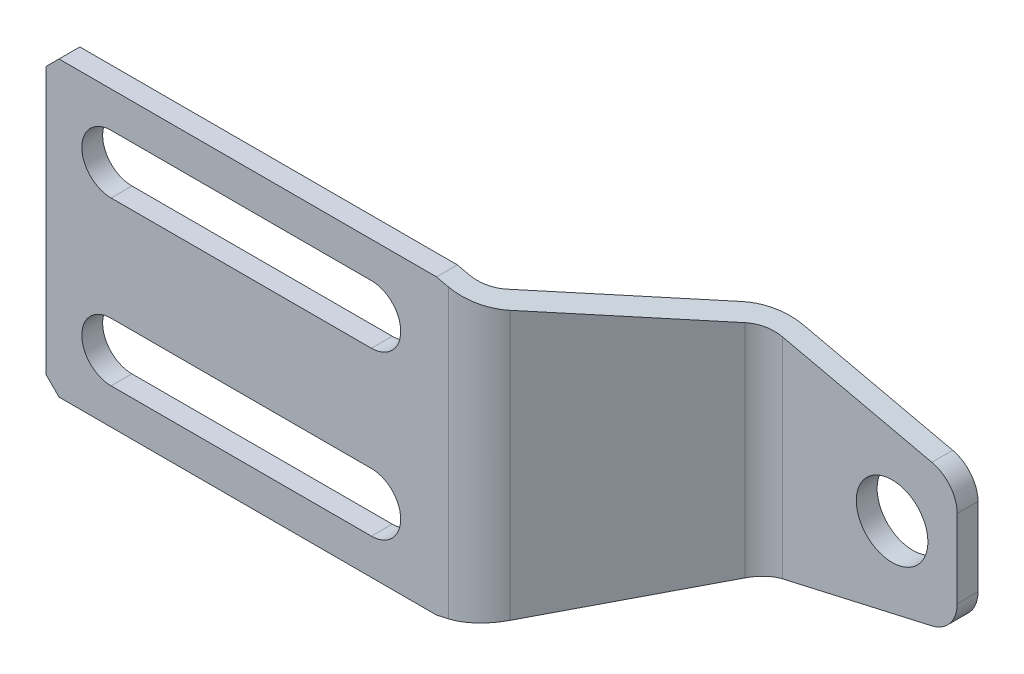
ISO-10303-21;
HEADER;
FILE_DESCRIPTION(('STEP AP214'),'2;1');
FILE_NAME('part.step','',(''),(''),'','','');
FILE_SCHEMA(('AUTOMOTIVE_DESIGN { 1 0 10303 214 1 1 1 1 }'));
ENDSEC;
DATA;
#1=APPLICATION_CONTEXT('core data for automotive mechanical design processes');
#2=APPLICATION_PROTOCOL_DEFINITION('international standard','automotive_design',2000,#1);
#3=PRODUCT_CONTEXT('',#1,'mechanical');
#4=PRODUCT('Part','Part','',(#3));
#5=PRODUCT_RELATED_PRODUCT_CATEGORY('part','',(#4));
#6=PRODUCT_DEFINITION_FORMATION('','',#4);
#7=PRODUCT_DEFINITION_CONTEXT('part definition',#1,'design');
#8=PRODUCT_DEFINITION('design','',#6,#7);
#9=PRODUCT_DEFINITION_SHAPE('','',#8);
#10=(LENGTH_UNIT() NAMED_UNIT(*) SI_UNIT(.MILLI.,.METRE.));
#11=(NAMED_UNIT(*) PLANE_ANGLE_UNIT() SI_UNIT($,.RADIAN.));
#12=(NAMED_UNIT(*) SI_UNIT($,.STERADIAN.) SOLID_ANGLE_UNIT());
#13=UNCERTAINTY_MEASURE_WITH_UNIT(LENGTH_MEASURE(1.E-05),#10,'distance_accuracy_value','');
#14=(GEOMETRIC_REPRESENTATION_CONTEXT(3) GLOBAL_UNCERTAINTY_ASSIGNED_CONTEXT((#13)) GLOBAL_UNIT_ASSIGNED_CONTEXT((#10,
#11,#12)) REPRESENTATION_CONTEXT('',''));
#15=CARTESIAN_POINT('',(0.,0.,0.));
#16=DIRECTION('',(0.,0.,1.));
#17=DIRECTION('',(1.,0.,0.));
#18=AXIS2_PLACEMENT_3D('',#15,#16,#17);
#19=CARTESIAN_POINT('',(95.,12.5,-75.));
#20=DIRECTION('',(0.,0.,1.));
#21=DIRECTION('',(0.,-1.,0.));
#22=AXIS2_PLACEMENT_3D('',#19,#20,#21);
#23=CYLINDRICAL_SURFACE('',#22,5.5);
#24=CARTESIAN_POINT('',(95.,12.5,-25.));
#25=DIRECTION('',(0.,0.,-1.));
#26=DIRECTION('',(1.,0.,0.));
#27=AXIS2_PLACEMENT_3D('',#24,#25,#26);
#28=CIRCLE('',#27,5.5);
#29=CARTESIAN_POINT('',(100.5,12.5,-25.));
#30=VERTEX_POINT('',#29);
#31=EDGE_CURVE('E238',#30,#30,#28,.F.);
#32=ORIENTED_EDGE('',*,*,#31,.F.);
#33=EDGE_LOOP('',(#32));
#34=FACE_BOUND('',#33,.T.);
#35=CARTESIAN_POINT('',(95.,12.5,-21.8));
#36=DIRECTION('',(0.,0.,1.));
#37=DIRECTION('',(0.,-1.,0.));
#38=AXIS2_PLACEMENT_3D('',#35,#36,#37);
#39=CIRCLE('',#38,5.5);
#40=CARTESIAN_POINT('',(95.,7.,-21.8));
#41=VERTEX_POINT('',#40);
#42=EDGE_CURVE('E243',#41,#41,#39,.F.);
#43=ORIENTED_EDGE('',*,*,#42,.F.);
#44=EDGE_LOOP('',(#43));
#45=FACE_BOUND('',#44,.T.);
#46=ADVANCED_FACE('F14',(#34,#45),#23,.F.);
#47=CARTESIAN_POINT('',(-10.,52.5,0.));
#48=DIRECTION('',(0.,0.,-1.));
#49=DIRECTION('',(0.,1.,0.));
#50=AXIS2_PLACEMENT_3D('',#47,#48,#49);
#51=PLANE('',#50);
#52=CARTESIAN_POINT('',(40.,25.,0.));
#53=DIRECTION('',(0.,0.,-1.));
#54=DIRECTION('',(0.,1.,0.));
#55=AXIS2_PLACEMENT_3D('',#52,#53,#54);
#56=CIRCLE('',#55,4.5);
#57=CARTESIAN_POINT('',(40.,20.5,0.));
#58=VERTEX_POINT('',#57);
#59=CARTESIAN_POINT('',(40.,29.5,0.));
#60=VERTEX_POINT('',#59);
#61=EDGE_CURVE('E320',#58,#60,#56,.F.);
#62=ORIENTED_EDGE('',*,*,#61,.T.);
#63=DIRECTION('',(-1.,0.,0.));
#64=VECTOR('',#63,1.);
#65=CARTESIAN_POINT('',(40.,29.5,0.));
#66=LINE('',#65,#64);
#67=CARTESIAN_POINT('',(0.,29.5,0.));
#68=VERTEX_POINT('',#67);
#69=EDGE_CURVE('E247',#60,#68,#66,.T.);
#70=ORIENTED_EDGE('',*,*,#69,.T.);
#71=CARTESIAN_POINT('',(0.,25.,0.));
#72=DIRECTION('',(0.,0.,-1.));
#73=DIRECTION('',(0.,1.,0.));
#74=AXIS2_PLACEMENT_3D('',#71,#72,#73);
#75=CIRCLE('',#74,4.5);
#76=CARTESIAN_POINT('',(0.,20.5,0.));
#77=VERTEX_POINT('',#76);
#78=EDGE_CURVE('E316',#68,#77,#75,.F.);
#79=ORIENTED_EDGE('',*,*,#78,.T.);
#80=DIRECTION('',(1.,0.,0.));
#81=VECTOR('',#80,1.);
#82=CARTESIAN_POINT('',(40.,20.5,0.));
#83=LINE('',#82,#81);
#84=EDGE_CURVE('E318',#77,#58,#83,.T.);
#85=ORIENTED_EDGE('',*,*,#84,.T.);
#86=EDGE_LOOP('',(#62,#70,#79,#85));
#87=FACE_BOUND('',#86,.T.);
#88=DIRECTION('',(-1.,0.,0.));
#89=VECTOR('',#88,1.);
#90=CARTESIAN_POINT('',(-8.,35.,0.));
#91=LINE('',#90,#89);
#92=CARTESIAN_POINT('',(50.,35.,0.));
#93=VERTEX_POINT('',#92);
#94=CARTESIAN_POINT('',(-8.,35.,0.));
#95=VERTEX_POINT('',#94);
#96=EDGE_CURVE('E340',#93,#95,#91,.T.);
#97=ORIENTED_EDGE('',*,*,#96,.F.);
#98=DIRECTION('',(-0.97513285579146,0.221621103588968,0.));
#99=VECTOR('',#98,1.);
#100=CARTESIAN_POINT('',(50.,35.,0.));
#101=LINE('',#100,#99);
#102=CARTESIAN_POINT('',(51.8278760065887,34.5845736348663,0.));
#103=VERTEX_POINT('',#102);
#104=EDGE_CURVE('E337',#103,#93,#101,.T.);
#105=ORIENTED_EDGE('',*,*,#104,.F.);
#106=DIRECTION('',(0.,-1.,0.));
#107=VECTOR('',#106,1.);
#108=CARTESIAN_POINT('',(51.8278760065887,52.5,0.));
#109=LINE('',#108,#107);
#110=CARTESIAN_POINT('',(51.8278760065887,-9.58457363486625,0.));
#111=VERTEX_POINT('',#110);
#112=EDGE_CURVE('E299',#103,#111,#109,.T.);
#113=ORIENTED_EDGE('',*,*,#112,.T.);
#114=DIRECTION('',(0.975132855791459,0.22162110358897,0.));
#115=VECTOR('',#114,1.);
#116=CARTESIAN_POINT('',(50.0000000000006,-10.,0.));
#117=LINE('',#116,#115);
#118=CARTESIAN_POINT('',(50.0000000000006,-10.,0.));
#119=VERTEX_POINT('',#118);
#120=EDGE_CURVE('E334',#119,#111,#117,.T.);
#121=ORIENTED_EDGE('',*,*,#120,.F.);
#122=DIRECTION('',(1.,0.,0.));
#123=VECTOR('',#122,1.);
#124=CARTESIAN_POINT('',(-8.,-10.,0.));
#125=LINE('',#124,#123);
#126=CARTESIAN_POINT('',(-8.,-10.,0.));
#127=VERTEX_POINT('',#126);
#128=EDGE_CURVE('E331',#127,#119,#125,.T.);
#129=ORIENTED_EDGE('',*,*,#128,.F.);
#130=DIRECTION('',(0.707106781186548,-0.707106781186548,0.));
#131=VECTOR('',#130,1.);
#132=CARTESIAN_POINT('',(-10.,-8.,0.));
#133=LINE('',#132,#131);
#134=CARTESIAN_POINT('',(-10.,-8.,0.));
#135=VERTEX_POINT('',#134);
#136=EDGE_CURVE('E29',#135,#127,#133,.T.);
#137=ORIENTED_EDGE('',*,*,#136,.F.);
#138=DIRECTION('',(0.,-1.,0.));
#139=VECTOR('',#138,1.);
#140=CARTESIAN_POINT('',(-10.,52.5,0.));
#141=LINE('',#140,#139);
#142=CARTESIAN_POINT('',(-10.,33.,0.));
#143=VERTEX_POINT('',#142);
#144=EDGE_CURVE('E302',#143,#135,#141,.T.);
#145=ORIENTED_EDGE('',*,*,#144,.F.);
#146=DIRECTION('',(-0.707106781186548,-0.707106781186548,0.));
#147=VECTOR('',#146,1.);
#148=CARTESIAN_POINT('',(-8.,35.,0.));
#149=LINE('',#148,#147);
#150=EDGE_CURVE('E343',#95,#143,#149,.T.);
#151=ORIENTED_EDGE('',*,*,#150,.F.);
#152=EDGE_LOOP('',(#97,#105,#113,#121,#129,#137,#145,#151));
#153=FACE_BOUND('',#152,.T.);
#154=CARTESIAN_POINT('',(40.,0.,0.));
#155=DIRECTION('',(0.,0.,-1.));
#156=DIRECTION('',(0.,1.,0.));
#157=AXIS2_PLACEMENT_3D('',#154,#155,#156);
#158=CIRCLE('',#157,4.5);
#159=CARTESIAN_POINT('',(40.,-4.5,0.));
#160=VERTEX_POINT('',#159);
#161=CARTESIAN_POINT('',(40.,4.5,0.));
#162=VERTEX_POINT('',#161);
#163=EDGE_CURVE('E328',#160,#162,#158,.F.);
#164=ORIENTED_EDGE('',*,*,#163,.T.);
#165=DIRECTION('',(-1.,0.,0.));
#166=VECTOR('',#165,1.);
#167=CARTESIAN_POINT('',(40.,4.5,0.));
#168=LINE('',#167,#166);
#169=CARTESIAN_POINT('',(0.,4.5,0.));
#170=VERTEX_POINT('',#169);
#171=EDGE_CURVE('E322',#162,#170,#168,.T.);
#172=ORIENTED_EDGE('',*,*,#171,.T.);
#173=CARTESIAN_POINT('',(0.,0.,0.));
#174=DIRECTION('',(0.,0.,-1.));
#175=DIRECTION('',(0.,1.,0.));
#176=AXIS2_PLACEMENT_3D('',#173,#174,#175);
#177=CIRCLE('',#176,4.5);
#178=CARTESIAN_POINT('',(0.,-4.5,0.));
#179=VERTEX_POINT('',#178);
#180=EDGE_CURVE('E324',#170,#179,#177,.F.);
#181=ORIENTED_EDGE('',*,*,#180,.T.);
#182=DIRECTION('',(1.,0.,0.));
#183=VECTOR('',#182,1.);
#184=CARTESIAN_POINT('',(40.,-4.5,0.));
#185=LINE('',#184,#183);
#186=EDGE_CURVE('E326',#179,#160,#185,.T.);
#187=ORIENTED_EDGE('',*,*,#186,.T.);
#188=EDGE_LOOP('',(#164,#172,#181,#187));
#189=FACE_BOUND('',#188,.T.);
#190=ADVANCED_FACE('F437',(#87,#153,#189),#51,.T.);
#191=CARTESIAN_POINT('',(51.8278760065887,52.5,-5.));
#192=DIRECTION('',(0.,-1.,0.));
#193=DIRECTION('',(0.,0.,-1.));
#194=AXIS2_PLACEMENT_3D('',#191,#192,#193);
#195=CYLINDRICAL_SURFACE('',#194,5.);
#196=DIRECTION('',(0.,-1.,0.));
#197=VECTOR('',#196,1.);
#198=CARTESIAN_POINT('',(55.7322200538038,52.5,-1.8765247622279));
#199=LINE('',#198,#197);
#200=CARTESIAN_POINT('',(55.7322200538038,33.6972227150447,-1.8765247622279));
#201=VERTEX_POINT('',#200);
#202=CARTESIAN_POINT('',(55.7322200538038,-8.69722271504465,-1.8765247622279));
#203=VERTEX_POINT('',#202);
#204=EDGE_CURVE('E296',#201,#203,#199,.T.);
#205=ORIENTED_EDGE('',*,*,#204,.T.);
#206=CARTESIAN_POINT('',(51.8278760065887,-9.58457363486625,-5.));
#207=DIRECTION('',(0.22162110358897,-0.97513285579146,0.));
#208=DIRECTION('',(-0.975132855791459,-0.22162110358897,0.));
#209=AXIS2_PLACEMENT_3D('',#206,#207,#208);
#210=ELLIPSE('',#209,5.12750644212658,5.);
#211=EDGE_CURVE('E252',#111,#203,#210,.F.);
#212=ORIENTED_EDGE('',*,*,#211,.F.);
#213=ORIENTED_EDGE('',*,*,#112,.F.);
#214=CARTESIAN_POINT('',(51.8278760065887,34.5845736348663,-5.));
#215=DIRECTION('',(0.221621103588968,0.97513285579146,0.));
#216=DIRECTION('',(0.97513285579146,-0.221621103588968,0.));
#217=AXIS2_PLACEMENT_3D('',#214,#215,#216);
#218=ELLIPSE('',#217,5.12750644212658,5.);
#219=EDGE_CURVE('E375',#201,#103,#218,.F.);
#220=ORIENTED_EDGE('',*,*,#219,.F.);
#221=EDGE_LOOP('',(#205,#212,#213,#220));
#222=FACE_BOUND('',#221,.T.);
#223=ADVANCED_FACE('F457',(#222),#195,.F.);
#224=CARTESIAN_POINT('',(71.7689997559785,52.5,-21.9224993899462));
#225=DIRECTION('',(-0.78086880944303,0.,-0.624695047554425));
#226=DIRECTION('',(0.624695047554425,0.,-0.78086880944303));
#227=AXIS2_PLACEMENT_3D('',#224,#225,#226);
#228=PLANE('',#227);
#229=DIRECTION('',(0.,-1.,0.));
#230=VECTOR('',#229,1.);
#231=CARTESIAN_POINT('',(71.7689997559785,52.5,-21.9224993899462));
#232=LINE('',#231,#230);
#233=CARTESIAN_POINT('',(71.7689997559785,30.0525000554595,-21.9224993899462));
#234=VERTEX_POINT('',#233);
#235=CARTESIAN_POINT('',(71.7689997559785,-5.05250005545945,-21.9224993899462));
#236=VERTEX_POINT('',#235);
#237=EDGE_CURVE('E293',#234,#236,#232,.T.);
#238=ORIENTED_EDGE('',*,*,#237,.T.);
#239=DIRECTION('',(0.618492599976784,0.140566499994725,-0.77311574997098));
#240=VECTOR('',#239,1.);
#241=CARTESIAN_POINT('',(88.3913803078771,-1.2746862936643,-42.7004750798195));
#242=LINE('',#241,#240);
#243=EDGE_CURVE('E255',#203,#236,#242,.T.);
#244=ORIENTED_EDGE('',*,*,#243,.F.);
#245=ORIENTED_EDGE('',*,*,#204,.F.);
#246=DIRECTION('',(-0.618492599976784,0.140566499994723,0.77311574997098));
#247=VECTOR('',#246,1.);
#248=CARTESIAN_POINT('',(88.3913803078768,26.2746862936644,-42.7004750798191));
#249=LINE('',#248,#247);
#250=EDGE_CURVE('E378',#234,#201,#249,.T.);
#251=ORIENTED_EDGE('',*,*,#250,.F.);
#252=EDGE_LOOP('',(#238,#244,#245,#251));
#253=FACE_BOUND('',#252,.T.);
#254=ADVANCED_FACE('F686',(#253),#228,.T.);
#255=CARTESIAN_POINT('',(78.1721239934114,52.5,-25.));
#256=DIRECTION('',(0.,0.,-1.));
#257=DIRECTION('',(1.,0.,0.));
#258=AXIS2_PLACEMENT_3D('',#255,#256,#257);
#259=PLANE('',#258);
#260=CARTESIAN_POINT('',(100.,18.5088571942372,-25.));
#261=DIRECTION('',(0.,0.,-1.));
#262=DIRECTION('',(1.,0.,0.));
#263=AXIS2_PLACEMENT_3D('',#260,#261,#262);
#264=CIRCLE('',#263,5.);
#265=CARTESIAN_POINT('',(105.,18.5088571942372,-25.));
#266=VERTEX_POINT('',#265);
#267=CARTESIAN_POINT('',(101.108105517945,23.3845214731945,-25.));
#268=VERTEX_POINT('',#267);
#269=EDGE_CURVE('E186',#266,#268,#264,.F.);
#270=ORIENTED_EDGE('',*,*,#269,.F.);
#271=DIRECTION('',(0.,-1.,0.));
#272=VECTOR('',#271,1.);
#273=CARTESIAN_POINT('',(105.,52.5,-25.));
#274=LINE('',#273,#272);
#275=CARTESIAN_POINT('',(105.,6.4911428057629,-25.));
#276=VERTEX_POINT('',#275);
#277=EDGE_CURVE('E190',#266,#276,#274,.T.);
#278=ORIENTED_EDGE('',*,*,#277,.T.);
#279=CARTESIAN_POINT('',(100.,6.4911428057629,-25.));
#280=DIRECTION('',(0.,0.,-1.));
#281=DIRECTION('',(1.,0.,0.));
#282=AXIS2_PLACEMENT_3D('',#279,#280,#281);
#283=CIRCLE('',#282,5.);
#284=CARTESIAN_POINT('',(101.108105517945,1.61547852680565,-25.));
#285=VERTEX_POINT('',#284);
#286=EDGE_CURVE('E199',#285,#276,#283,.F.);
#287=ORIENTED_EDGE('',*,*,#286,.F.);
#288=DIRECTION('',(0.975132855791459,0.22162110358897,0.));
#289=VECTOR('',#288,1.);
#290=CARTESIAN_POINT('',(50.0000000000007,-10.,-25.));
#291=LINE('',#290,#289);
#292=CARTESIAN_POINT('',(78.1721239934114,-3.59724454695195,-25.));
#293=VERTEX_POINT('',#292);
#294=EDGE_CURVE('E241',#293,#285,#291,.T.);
#295=ORIENTED_EDGE('',*,*,#294,.F.);
#296=DIRECTION('',(0.,-1.,0.));
#297=VECTOR('',#296,1.);
#298=CARTESIAN_POINT('',(78.1721239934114,52.5,-25.));
#299=LINE('',#298,#297);
#300=CARTESIAN_POINT('',(78.1721239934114,28.597244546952,-25.));
#301=VERTEX_POINT('',#300);
#302=EDGE_CURVE('E210',#301,#293,#299,.T.);
#303=ORIENTED_EDGE('',*,*,#302,.F.);
#304=DIRECTION('',(-0.97513285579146,0.221621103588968,0.));
#305=VECTOR('',#304,1.);
#306=CARTESIAN_POINT('',(50.,35.,-25.));
#307=LINE('',#306,#305);
#308=EDGE_CURVE('E194',#268,#301,#307,.T.);
#309=ORIENTED_EDGE('',*,*,#308,.F.);
#310=EDGE_LOOP('',(#270,#278,#287,#295,#303,#309));
#311=FACE_BOUND('',#310,.T.);
#312=ORIENTED_EDGE('',*,*,#31,.T.);
#313=EDGE_LOOP('',(#312));
#314=FACE_BOUND('',#313,.T.);
#315=ADVANCED_FACE('F188',(#311,#314),#259,.T.);
#316=CARTESIAN_POINT('',(78.1721239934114,52.5,-16.8));
#317=DIRECTION('',(0.,-1.,0.));
#318=DIRECTION('',(0.,0.,-1.));
#319=AXIS2_PLACEMENT_3D('',#316,#317,#318);
#320=CYLINDRICAL_SURFACE('',#319,8.2);
#321=ORIENTED_EDGE('',*,*,#302,.T.);
#322=CARTESIAN_POINT('',(78.1721239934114,-3.59724454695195,-16.8));
#323=DIRECTION('',(0.22162110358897,-0.97513285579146,0.));
#324=DIRECTION('',(-0.975132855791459,-0.22162110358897,0.));
#325=AXIS2_PLACEMENT_3D('',#322,#323,#324);
#326=ELLIPSE('',#325,8.4091105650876,8.2);
#327=EDGE_CURVE('E258',#236,#293,#326,.T.);
#328=ORIENTED_EDGE('',*,*,#327,.F.);
#329=ORIENTED_EDGE('',*,*,#237,.F.);
#330=CARTESIAN_POINT('',(78.1721239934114,28.597244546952,-16.8));
#331=DIRECTION('',(0.221621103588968,0.97513285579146,0.));
#332=DIRECTION('',(0.97513285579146,-0.221621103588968,0.));
#333=AXIS2_PLACEMENT_3D('',#330,#331,#332);
#334=ELLIPSE('',#333,8.4091105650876,8.2);
#335=EDGE_CURVE('E381',#301,#234,#334,.T.);
#336=ORIENTED_EDGE('',*,*,#335,.F.);
#337=EDGE_LOOP('',(#321,#328,#329,#336));
#338=FACE_BOUND('',#337,.T.);
#339=ADVANCED_FACE('F667',(#338),#320,.T.);
#340=CARTESIAN_POINT('',(-10.,52.5,3.2));
#341=DIRECTION('',(0.,0.,1.));
#342=DIRECTION('',(0.,-1.,0.));
#343=AXIS2_PLACEMENT_3D('',#340,#341,#342);
#344=PLANE('',#343);
#345=CARTESIAN_POINT('',(40.,25.,3.2));
#346=DIRECTION('',(0.,0.,1.));
#347=DIRECTION('',(0.,-1.,0.));
#348=AXIS2_PLACEMENT_3D('',#345,#346,#347);
#349=CIRCLE('',#348,4.5);
#350=CARTESIAN_POINT('',(40.,29.5,3.2));
#351=VERTEX_POINT('',#350);
#352=CARTESIAN_POINT('',(40.,20.5,3.2));
#353=VERTEX_POINT('',#352);
#354=EDGE_CURVE('E350',#351,#353,#349,.F.);
#355=ORIENTED_EDGE('',*,*,#354,.T.);
#356=DIRECTION('',(-1.,0.,0.));
#357=VECTOR('',#356,1.);
#358=CARTESIAN_POINT('',(40.,20.5,3.2));
#359=LINE('',#358,#357);
#360=CARTESIAN_POINT('',(0.,20.5,3.2));
#361=VERTEX_POINT('',#360);
#362=EDGE_CURVE('E348',#353,#361,#359,.T.);
#363=ORIENTED_EDGE('',*,*,#362,.T.);
#364=CARTESIAN_POINT('',(0.,25.,3.2));
#365=DIRECTION('',(0.,0.,1.));
#366=DIRECTION('',(0.,-1.,0.));
#367=AXIS2_PLACEMENT_3D('',#364,#365,#366);
#368=CIRCLE('',#367,4.5);
#369=CARTESIAN_POINT('',(0.,29.5,3.2));
#370=VERTEX_POINT('',#369);
#371=EDGE_CURVE('E346',#361,#370,#368,.F.);
#372=ORIENTED_EDGE('',*,*,#371,.T.);
#373=DIRECTION('',(1.,0.,0.));
#374=VECTOR('',#373,1.);
#375=CARTESIAN_POINT('',(40.,29.5,3.2));
#376=LINE('',#375,#374);
#377=EDGE_CURVE('E249',#370,#351,#376,.T.);
#378=ORIENTED_EDGE('',*,*,#377,.T.);
#379=EDGE_LOOP('',(#355,#363,#372,#378));
#380=FACE_BOUND('',#379,.T.);
#381=DIRECTION('',(0.,-1.,0.));
#382=VECTOR('',#381,1.);
#383=CARTESIAN_POINT('',(-10.,52.5,3.2));
#384=LINE('',#383,#382);
#385=CARTESIAN_POINT('',(-10.,33.,3.2));
#386=VERTEX_POINT('',#385);
#387=CARTESIAN_POINT('',(-10.,-8.,3.2));
#388=VERTEX_POINT('',#387);
#389=EDGE_CURVE('E242',#386,#388,#384,.T.);
#390=ORIENTED_EDGE('',*,*,#389,.T.);
#391=DIRECTION('',(-0.707106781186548,0.707106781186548,0.));
#392=VECTOR('',#391,1.);
#393=CARTESIAN_POINT('',(-10.,-8.,3.2));
#394=LINE('',#393,#392);
#395=CARTESIAN_POINT('',(-8.,-10.,3.2));
#396=VERTEX_POINT('',#395);
#397=EDGE_CURVE('E360',#396,#388,#394,.T.);
#398=ORIENTED_EDGE('',*,*,#397,.F.);
#399=DIRECTION('',(-1.,0.,0.));
#400=VECTOR('',#399,1.);
#401=CARTESIAN_POINT('',(-8.,-10.,3.2));
#402=LINE('',#401,#400);
#403=CARTESIAN_POINT('',(50.0000000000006,-10.,3.2));
#404=VERTEX_POINT('',#403);
#405=EDGE_CURVE('E363',#404,#396,#402,.T.);
#406=ORIENTED_EDGE('',*,*,#405,.F.);
#407=DIRECTION('',(-0.975132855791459,-0.22162110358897,0.));
#408=VECTOR('',#407,1.);
#409=CARTESIAN_POINT('',(50.0000000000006,-10.,3.2));
#410=LINE('',#409,#408);
#411=CARTESIAN_POINT('',(51.8278760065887,-9.58457363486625,3.2));
#412=VERTEX_POINT('',#411);
#413=EDGE_CURVE('E366',#412,#404,#410,.T.);
#414=ORIENTED_EDGE('',*,*,#413,.F.);
#415=DIRECTION('',(0.,-1.,0.));
#416=VECTOR('',#415,1.);
#417=CARTESIAN_POINT('',(51.8278760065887,52.5,3.2));
#418=LINE('',#417,#416);
#419=CARTESIAN_POINT('',(51.8278760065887,34.5845736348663,3.2));
#420=VERTEX_POINT('',#419);
#421=EDGE_CURVE('E285',#420,#412,#418,.T.);
#422=ORIENTED_EDGE('',*,*,#421,.F.);
#423=DIRECTION('',(0.97513285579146,-0.221621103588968,0.));
#424=VECTOR('',#423,1.);
#425=CARTESIAN_POINT('',(50.,35.,3.2));
#426=LINE('',#425,#424);
#427=CARTESIAN_POINT('',(50.,35.,3.2));
#428=VERTEX_POINT('',#427);
#429=EDGE_CURVE('E368',#428,#420,#426,.T.);
#430=ORIENTED_EDGE('',*,*,#429,.F.);
#431=DIRECTION('',(1.,0.,0.));
#432=VECTOR('',#431,1.);
#433=CARTESIAN_POINT('',(-8.,35.,3.2));
#434=LINE('',#433,#432);
#435=CARTESIAN_POINT('',(-8.,35.,3.2));
#436=VERTEX_POINT('',#435);
#437=EDGE_CURVE('E371',#436,#428,#434,.T.);
#438=ORIENTED_EDGE('',*,*,#437,.F.);
#439=DIRECTION('',(0.707106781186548,0.707106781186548,0.));
#440=VECTOR('',#439,1.);
#441=CARTESIAN_POINT('',(-8.,35.,3.2));
#442=LINE('',#441,#440);
#443=EDGE_CURVE('E37',#386,#436,#442,.T.);
#444=ORIENTED_EDGE('',*,*,#443,.F.);
#445=EDGE_LOOP('',(#390,#398,#406,#414,#422,#430,#438,#444));
#446=FACE_BOUND('',#445,.T.);
#447=CARTESIAN_POINT('',(40.,0.,3.2));
#448=DIRECTION('',(0.,0.,1.));
#449=DIRECTION('',(0.,-1.,0.));
#450=AXIS2_PLACEMENT_3D('',#447,#448,#449);
#451=CIRCLE('',#450,4.5);
#452=CARTESIAN_POINT('',(40.,4.5,3.2));
#453=VERTEX_POINT('',#452);
#454=CARTESIAN_POINT('',(40.,-4.5,3.2));
#455=VERTEX_POINT('',#454);
#456=EDGE_CURVE('E358',#453,#455,#451,.F.);
#457=ORIENTED_EDGE('',*,*,#456,.T.);
#458=DIRECTION('',(-1.,0.,0.));
#459=VECTOR('',#458,1.);
#460=CARTESIAN_POINT('',(40.,-4.5,3.2));
#461=LINE('',#460,#459);
#462=CARTESIAN_POINT('',(0.,-4.5,3.2));
#463=VERTEX_POINT('',#462);
#464=EDGE_CURVE('E356',#455,#463,#461,.T.);
#465=ORIENTED_EDGE('',*,*,#464,.T.);
#466=CARTESIAN_POINT('',(0.,0.,3.2));
#467=DIRECTION('',(0.,0.,1.));
#468=DIRECTION('',(0.,-1.,0.));
#469=AXIS2_PLACEMENT_3D('',#466,#467,#468);
#470=CIRCLE('',#469,4.5);
#471=CARTESIAN_POINT('',(0.,4.5,3.2));
#472=VERTEX_POINT('',#471);
#473=EDGE_CURVE('E354',#463,#472,#470,.F.);
#474=ORIENTED_EDGE('',*,*,#473,.T.);
#475=DIRECTION('',(1.,0.,0.));
#476=VECTOR('',#475,1.);
#477=CARTESIAN_POINT('',(40.,4.5,3.2));
#478=LINE('',#477,#476);
#479=EDGE_CURVE('E352',#472,#453,#478,.T.);
#480=ORIENTED_EDGE('',*,*,#479,.T.);
#481=EDGE_LOOP('',(#457,#465,#474,#480));
#482=FACE_BOUND('',#481,.T.);
#483=ADVANCED_FACE('F421',(#380,#446,#482),#344,.T.);
#484=CARTESIAN_POINT('',(78.1721239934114,52.5,-21.8));
#485=DIRECTION('',(0.,0.,1.));
#486=DIRECTION('',(0.,-1.,0.));
#487=AXIS2_PLACEMENT_3D('',#484,#485,#486);
#488=PLANE('',#487);
#489=DIRECTION('',(0.,-1.,0.));
#490=VECTOR('',#489,1.);
#491=CARTESIAN_POINT('',(78.1721239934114,52.5,-21.8));
#492=LINE('',#491,#490);
#493=CARTESIAN_POINT('',(78.1721239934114,28.597244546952,-21.8));
#494=VERTEX_POINT('',#493);
#495=CARTESIAN_POINT('',(78.1721239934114,-3.597244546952,-21.8));
#496=VERTEX_POINT('',#495);
#497=EDGE_CURVE('E283',#494,#496,#492,.T.);
#498=ORIENTED_EDGE('',*,*,#497,.T.);
#499=DIRECTION('',(-0.975132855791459,-0.22162110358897,0.));
#500=VECTOR('',#499,1.);
#501=CARTESIAN_POINT('',(50.0000000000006,-10.,-21.8));
#502=LINE('',#501,#500);
#503=CARTESIAN_POINT('',(101.108105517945,1.61547852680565,-21.8));
#504=VERTEX_POINT('',#503);
#505=EDGE_CURVE('E246',#504,#496,#502,.T.);
#506=ORIENTED_EDGE('',*,*,#505,.F.);
#507=CARTESIAN_POINT('',(100.,6.4911428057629,-21.8));
#508=DIRECTION('',(0.,0.,1.));
#509=DIRECTION('',(0.,-1.,0.));
#510=AXIS2_PLACEMENT_3D('',#507,#508,#509);
#511=CIRCLE('',#510,5.);
#512=CARTESIAN_POINT('',(105.,6.4911428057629,-21.8));
#513=VERTEX_POINT('',#512);
#514=EDGE_CURVE('E309',#513,#504,#511,.F.);
#515=ORIENTED_EDGE('',*,*,#514,.F.);
#516=DIRECTION('',(0.,-1.,0.));
#517=VECTOR('',#516,1.);
#518=CARTESIAN_POINT('',(105.,52.5,-21.8));
#519=LINE('',#518,#517);
#520=CARTESIAN_POINT('',(105.,18.5088571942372,-21.8));
#521=VERTEX_POINT('',#520);
#522=EDGE_CURVE('E209',#521,#513,#519,.T.);
#523=ORIENTED_EDGE('',*,*,#522,.F.);
#524=CARTESIAN_POINT('',(100.,18.5088571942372,-21.8));
#525=DIRECTION('',(0.,0.,1.));
#526=DIRECTION('',(0.,-1.,0.));
#527=AXIS2_PLACEMENT_3D('',#524,#525,#526);
#528=CIRCLE('',#527,5.);
#529=CARTESIAN_POINT('',(101.108105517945,23.3845214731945,-21.8));
#530=VERTEX_POINT('',#529);
#531=EDGE_CURVE('E214',#530,#521,#528,.F.);
#532=ORIENTED_EDGE('',*,*,#531,.F.);
#533=DIRECTION('',(0.97513285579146,-0.221621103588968,0.));
#534=VECTOR('',#533,1.);
#535=CARTESIAN_POINT('',(50.,35.,-21.8));
#536=LINE('',#535,#534);
#537=EDGE_CURVE('E313',#494,#530,#536,.T.);
#538=ORIENTED_EDGE('',*,*,#537,.F.);
#539=EDGE_LOOP('',(#498,#506,#515,#523,#532,#538));
#540=FACE_BOUND('',#539,.T.);
#541=ORIENTED_EDGE('',*,*,#42,.T.);
#542=EDGE_LOOP('',(#541));
#543=FACE_BOUND('',#542,.T.);
#544=ADVANCED_FACE('F649',(#540,#543),#488,.T.);
#545=CARTESIAN_POINT('',(51.8278760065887,52.5,-5.));
#546=DIRECTION('',(0.,-1.,0.));
#547=DIRECTION('',(0.,0.,-1.));
#548=AXIS2_PLACEMENT_3D('',#545,#546,#547);
#549=CYLINDRICAL_SURFACE('',#548,8.2);
#550=ORIENTED_EDGE('',*,*,#421,.T.);
#551=CARTESIAN_POINT('',(51.8278760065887,-9.58457363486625,-5.));
#552=DIRECTION('',(0.22162110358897,-0.97513285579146,0.));
#553=DIRECTION('',(-0.975132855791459,-0.22162110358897,0.));
#554=AXIS2_PLACEMENT_3D('',#551,#552,#553);
#555=ELLIPSE('',#554,8.40911056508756,8.2);
#556=CARTESIAN_POINT('',(58.2310002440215,-8.1293181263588,0.122499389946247));
#557=VERTEX_POINT('',#556);
#558=EDGE_CURVE('E9',#557,#412,#555,.T.);
#559=ORIENTED_EDGE('',*,*,#558,.F.);
#560=DIRECTION('',(0.,-1.,0.));
#561=VECTOR('',#560,1.);
#562=CARTESIAN_POINT('',(58.2310002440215,52.5,0.122499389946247));
#563=LINE('',#562,#561);
#564=CARTESIAN_POINT('',(58.2310002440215,33.1293181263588,0.122499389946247));
#565=VERTEX_POINT('',#564);
#566=EDGE_CURVE('E276',#565,#557,#563,.T.);
#567=ORIENTED_EDGE('',*,*,#566,.F.);
#568=CARTESIAN_POINT('',(51.8278760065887,34.5845736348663,-5.));
#569=DIRECTION('',(0.221621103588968,0.97513285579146,0.));
#570=DIRECTION('',(0.97513285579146,-0.221621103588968,0.));
#571=AXIS2_PLACEMENT_3D('',#568,#569,#570);
#572=ELLIPSE('',#571,8.40911056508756,8.2);
#573=EDGE_CURVE('E387',#420,#565,#572,.T.);
#574=ORIENTED_EDGE('',*,*,#573,.F.);
#575=EDGE_LOOP('',(#550,#559,#567,#574));
#576=FACE_BOUND('',#575,.T.);
#577=ADVANCED_FACE('F432',(#576),#549,.T.);
#578=CARTESIAN_POINT('',(74.2677799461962,52.5,-19.9234752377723));
#579=DIRECTION('',(0.780868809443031,0.,0.624695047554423));
#580=DIRECTION('',(-0.624695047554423,0.,0.780868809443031));
#581=AXIS2_PLACEMENT_3D('',#578,#579,#580);
#582=PLANE('',#581);
#583=ORIENTED_EDGE('',*,*,#566,.T.);
#584=DIRECTION('',(-0.618492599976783,-0.140566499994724,0.773115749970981));
#585=VECTOR('',#584,1.);
#586=CARTESIAN_POINT('',(90.8407872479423,-0.718002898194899,-40.6397343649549));
#587=LINE('',#586,#585);
#588=CARTESIAN_POINT('',(74.2677799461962,-4.4845954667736,-19.9234752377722));
#589=VERTEX_POINT('',#588);
#590=EDGE_CURVE('E22',#589,#557,#587,.T.);
#591=ORIENTED_EDGE('',*,*,#590,.F.);
#592=DIRECTION('',(0.,-1.,0.));
#593=VECTOR('',#592,1.);
#594=CARTESIAN_POINT('',(74.2677799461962,52.5,-19.9234752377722));
#595=LINE('',#594,#593);
#596=CARTESIAN_POINT('',(74.2677799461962,29.4845954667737,-19.9234752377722));
#597=VERTEX_POINT('',#596);
#598=EDGE_CURVE('E273',#597,#589,#595,.T.);
#599=ORIENTED_EDGE('',*,*,#598,.F.);
#600=DIRECTION('',(0.618492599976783,-0.140566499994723,-0.773115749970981));
#601=VECTOR('',#600,1.);
#602=CARTESIAN_POINT('',(90.840787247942,25.718002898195,-40.6397343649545));
#603=LINE('',#602,#601);
#604=EDGE_CURVE('E385',#565,#597,#603,.T.);
#605=ORIENTED_EDGE('',*,*,#604,.F.);
#606=EDGE_LOOP('',(#583,#591,#599,#605));
#607=FACE_BOUND('',#606,.T.);
#608=ADVANCED_FACE('F272',(#607),#582,.T.);
#609=CARTESIAN_POINT('',(78.1721239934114,52.5,-16.8));
#610=DIRECTION('',(0.,-1.,0.));
#611=DIRECTION('',(0.,0.,-1.));
#612=AXIS2_PLACEMENT_3D('',#609,#610,#611);
#613=CYLINDRICAL_SURFACE('',#612,5.);
#614=ORIENTED_EDGE('',*,*,#598,.T.);
#615=CARTESIAN_POINT('',(78.1721239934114,-3.59724454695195,-16.8));
#616=DIRECTION('',(0.22162110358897,-0.97513285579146,0.));
#617=DIRECTION('',(-0.975132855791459,-0.22162110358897,0.));
#618=AXIS2_PLACEMENT_3D('',#615,#616,#617);
#619=ELLIPSE('',#618,5.12750644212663,5.);
#620=EDGE_CURVE('E261',#496,#589,#619,.F.);
#621=ORIENTED_EDGE('',*,*,#620,.F.);
#622=ORIENTED_EDGE('',*,*,#497,.F.);
#623=CARTESIAN_POINT('',(78.1721239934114,28.597244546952,-16.8));
#624=DIRECTION('',(0.221621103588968,0.97513285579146,0.));
#625=DIRECTION('',(0.97513285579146,-0.221621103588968,0.));
#626=AXIS2_PLACEMENT_3D('',#623,#624,#625);
#627=ELLIPSE('',#626,5.12750644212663,5.);
#628=EDGE_CURVE('E282',#597,#494,#627,.F.);
#629=ORIENTED_EDGE('',*,*,#628,.F.);
#630=EDGE_LOOP('',(#614,#621,#622,#629));
#631=FACE_BOUND('',#630,.T.);
#632=ADVANCED_FACE('F278',(#631),#613,.F.);
#633=CARTESIAN_POINT('',(40.,29.5,-75.));
#634=DIRECTION('',(0.,1.,0.));
#635=DIRECTION('',(0.,0.,1.));
#636=AXIS2_PLACEMENT_3D('',#633,#634,#635);
#637=PLANE('',#636);
#638=ORIENTED_EDGE('',*,*,#377,.F.);
#639=DIRECTION('',(0.,0.,1.));
#640=VECTOR('',#639,1.);
#641=CARTESIAN_POINT('',(0.,29.5,-75.));
#642=LINE('',#641,#640);
#643=EDGE_CURVE('E398',#68,#370,#642,.T.);
#644=ORIENTED_EDGE('',*,*,#643,.F.);
#645=ORIENTED_EDGE('',*,*,#69,.F.);
#646=DIRECTION('',(0.,0.,1.));
#647=VECTOR('',#646,1.);
#648=CARTESIAN_POINT('',(40.,29.5,-75.));
#649=LINE('',#648,#647);
#650=EDGE_CURVE('E390',#60,#351,#649,.T.);
#651=ORIENTED_EDGE('',*,*,#650,.T.);
#652=EDGE_LOOP('',(#638,#644,#645,#651));
#653=FACE_BOUND('',#652,.T.);
#654=ADVANCED_FACE('F472',(#653),#637,.F.);
#655=CARTESIAN_POINT('',(0.,25.,-75.));
#656=DIRECTION('',(0.,0.,1.));
#657=DIRECTION('',(0.,-1.,0.));
#658=AXIS2_PLACEMENT_3D('',#655,#656,#657);
#659=CYLINDRICAL_SURFACE('',#658,4.5);
#660=ORIENTED_EDGE('',*,*,#371,.F.);
#661=DIRECTION('',(0.,0.,1.));
#662=VECTOR('',#661,1.);
#663=CARTESIAN_POINT('',(0.,20.5,-75.));
#664=LINE('',#663,#662);
#665=EDGE_CURVE('E395',#77,#361,#664,.T.);
#666=ORIENTED_EDGE('',*,*,#665,.F.);
#667=ORIENTED_EDGE('',*,*,#78,.F.);
#668=ORIENTED_EDGE('',*,*,#643,.T.);
#669=EDGE_LOOP('',(#660,#666,#667,#668));
#670=FACE_BOUND('',#669,.T.);
#671=ADVANCED_FACE('F468',(#670),#659,.F.);
#672=CARTESIAN_POINT('',(40.,20.5,-75.));
#673=DIRECTION('',(0.,-1.,0.));
#674=DIRECTION('',(0.,0.,-1.));
#675=AXIS2_PLACEMENT_3D('',#672,#673,#674);
#676=PLANE('',#675);
#677=ORIENTED_EDGE('',*,*,#362,.F.);
#678=DIRECTION('',(0.,0.,1.));
#679=VECTOR('',#678,1.);
#680=CARTESIAN_POINT('',(40.,20.5,-75.));
#681=LINE('',#680,#679);
#682=EDGE_CURVE('E391',#58,#353,#681,.T.);
#683=ORIENTED_EDGE('',*,*,#682,.F.);
#684=ORIENTED_EDGE('',*,*,#84,.F.);
#685=ORIENTED_EDGE('',*,*,#665,.T.);
#686=EDGE_LOOP('',(#677,#683,#684,#685));
#687=FACE_BOUND('',#686,.T.);
#688=ADVANCED_FACE('F464',(#687),#676,.F.);
#689=CARTESIAN_POINT('',(40.,25.,-75.));
#690=DIRECTION('',(0.,0.,1.));
#691=DIRECTION('',(0.,-1.,0.));
#692=AXIS2_PLACEMENT_3D('',#689,#690,#691);
#693=CYLINDRICAL_SURFACE('',#692,4.5);
#694=ORIENTED_EDGE('',*,*,#354,.F.);
#695=ORIENTED_EDGE('',*,*,#650,.F.);
#696=ORIENTED_EDGE('',*,*,#61,.F.);
#697=ORIENTED_EDGE('',*,*,#682,.T.);
#698=EDGE_LOOP('',(#694,#695,#696,#697));
#699=FACE_BOUND('',#698,.T.);
#700=ADVANCED_FACE('F467',(#699),#693,.F.);
#701=CARTESIAN_POINT('',(40.,4.5,-75.));
#702=DIRECTION('',(0.,1.,0.));
#703=DIRECTION('',(0.,0.,1.));
#704=AXIS2_PLACEMENT_3D('',#701,#702,#703);
#705=PLANE('',#704);
#706=ORIENTED_EDGE('',*,*,#479,.F.);
#707=DIRECTION('',(0.,0.,1.));
#708=VECTOR('',#707,1.);
#709=CARTESIAN_POINT('',(0.,4.5,-75.));
#710=LINE('',#709,#708);
#711=EDGE_CURVE('E408',#170,#472,#710,.T.);
#712=ORIENTED_EDGE('',*,*,#711,.F.);
#713=ORIENTED_EDGE('',*,*,#171,.F.);
#714=DIRECTION('',(0.,0.,1.));
#715=VECTOR('',#714,1.);
#716=CARTESIAN_POINT('',(40.,4.5,-75.));
#717=LINE('',#716,#715);
#718=EDGE_CURVE('E394',#162,#453,#717,.T.);
#719=ORIENTED_EDGE('',*,*,#718,.T.);
#720=EDGE_LOOP('',(#706,#712,#713,#719));
#721=FACE_BOUND('',#720,.T.);
#722=ADVANCED_FACE('F479',(#721),#705,.F.);
#723=CARTESIAN_POINT('',(0.,0.,-75.));
#724=DIRECTION('',(0.,0.,1.));
#725=DIRECTION('',(0.,-1.,0.));
#726=AXIS2_PLACEMENT_3D('',#723,#724,#725);
#727=CYLINDRICAL_SURFACE('',#726,4.5);
#728=ORIENTED_EDGE('',*,*,#473,.F.);
#729=DIRECTION('',(0.,0.,1.));
#730=VECTOR('',#729,1.);
#731=CARTESIAN_POINT('',(0.,-4.5,-75.));
#732=LINE('',#731,#730);
#733=EDGE_CURVE('E405',#179,#463,#732,.T.);
#734=ORIENTED_EDGE('',*,*,#733,.F.);
#735=ORIENTED_EDGE('',*,*,#180,.F.);
#736=ORIENTED_EDGE('',*,*,#711,.T.);
#737=EDGE_LOOP('',(#728,#734,#735,#736));
#738=FACE_BOUND('',#737,.T.);
#739=ADVANCED_FACE('F485',(#738),#727,.F.);
#740=CARTESIAN_POINT('',(40.,-4.5,-75.));
#741=DIRECTION('',(0.,-1.,0.));
#742=DIRECTION('',(0.,0.,-1.));
#743=AXIS2_PLACEMENT_3D('',#740,#741,#742);
#744=PLANE('',#743);
#745=ORIENTED_EDGE('',*,*,#464,.F.);
#746=DIRECTION('',(0.,0.,1.));
#747=VECTOR('',#746,1.);
#748=CARTESIAN_POINT('',(40.,-4.5,-75.));
#749=LINE('',#748,#747);
#750=EDGE_CURVE('E237',#160,#455,#749,.T.);
#751=ORIENTED_EDGE('',*,*,#750,.F.);
#752=ORIENTED_EDGE('',*,*,#186,.F.);
#753=ORIENTED_EDGE('',*,*,#733,.T.);
#754=EDGE_LOOP('',(#745,#751,#752,#753));
#755=FACE_BOUND('',#754,.T.);
#756=ADVANCED_FACE('F481',(#755),#744,.F.);
#757=CARTESIAN_POINT('',(40.,0.,-75.));
#758=DIRECTION('',(0.,0.,1.));
#759=DIRECTION('',(0.,-1.,0.));
#760=AXIS2_PLACEMENT_3D('',#757,#758,#759);
#761=CYLINDRICAL_SURFACE('',#760,4.5);
#762=ORIENTED_EDGE('',*,*,#456,.F.);
#763=ORIENTED_EDGE('',*,*,#718,.F.);
#764=ORIENTED_EDGE('',*,*,#163,.F.);
#765=ORIENTED_EDGE('',*,*,#750,.T.);
#766=EDGE_LOOP('',(#762,#763,#764,#765));
#767=FACE_BOUND('',#766,.T.);
#768=ADVANCED_FACE('F484',(#767),#761,.F.);
#769=CARTESIAN_POINT('',(-8.,35.,-75.));
#770=DIRECTION('',(-0.707106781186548,0.707106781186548,0.));
#771=DIRECTION('',(-0.707106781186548,-0.707106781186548,0.));
#772=AXIS2_PLACEMENT_3D('',#769,#770,#771);
#773=PLANE('',#772);
#774=DIRECTION('',(0.,0.,1.));
#775=VECTOR('',#774,1.);
#776=CARTESIAN_POINT('',(-10.,33.,-75.));
#777=LINE('',#776,#775);
#778=EDGE_CURVE('E234',#143,#386,#777,.T.);
#779=ORIENTED_EDGE('',*,*,#778,.T.);
#780=ORIENTED_EDGE('',*,*,#443,.T.);
#781=DIRECTION('',(0.,0.,1.));
#782=VECTOR('',#781,1.);
#783=CARTESIAN_POINT('',(-8.,35.,-75.));
#784=LINE('',#783,#782);
#785=EDGE_CURVE('E250',#95,#436,#784,.T.);
#786=ORIENTED_EDGE('',*,*,#785,.F.);
#787=ORIENTED_EDGE('',*,*,#150,.T.);
#788=EDGE_LOOP('',(#779,#780,#786,#787));
#789=FACE_BOUND('',#788,.T.);
#790=ADVANCED_FACE('F16',(#789),#773,.T.);
#791=CARTESIAN_POINT('',(-8.,35.,-75.));
#792=DIRECTION('',(0.,1.,0.));
#793=DIRECTION('',(-1.,0.,0.));
#794=AXIS2_PLACEMENT_3D('',#791,#792,#793);
#795=PLANE('',#794);
#796=ORIENTED_EDGE('',*,*,#785,.T.);
#797=ORIENTED_EDGE('',*,*,#437,.T.);
#798=DIRECTION('',(0.,0.,1.));
#799=VECTOR('',#798,1.);
#800=CARTESIAN_POINT('',(50.,35.,-75.));
#801=LINE('',#800,#799);
#802=EDGE_CURVE('E217',#93,#428,#801,.T.);
#803=ORIENTED_EDGE('',*,*,#802,.F.);
#804=ORIENTED_EDGE('',*,*,#96,.T.);
#805=EDGE_LOOP('',(#796,#797,#803,#804));
#806=FACE_BOUND('',#805,.T.);
#807=ADVANCED_FACE('F419',(#806),#795,.T.);
#808=CARTESIAN_POINT('',(50.,35.,-75.));
#809=DIRECTION('',(0.221621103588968,0.97513285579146,0.));
#810=DIRECTION('',(-0.97513285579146,0.221621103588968,0.));
#811=AXIS2_PLACEMENT_3D('',#808,#809,#810);
#812=PLANE('',#811);
#813=ORIENTED_EDGE('',*,*,#802,.T.);
#814=ORIENTED_EDGE('',*,*,#429,.T.);
#815=ORIENTED_EDGE('',*,*,#573,.T.);
#816=ORIENTED_EDGE('',*,*,#604,.T.);
#817=ORIENTED_EDGE('',*,*,#628,.T.);
#818=ORIENTED_EDGE('',*,*,#537,.T.);
#819=DIRECTION('',(0.,0.,1.));
#820=VECTOR('',#819,1.);
#821=CARTESIAN_POINT('',(101.108105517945,23.3845214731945,-75.));
#822=LINE('',#821,#820);
#823=EDGE_CURVE('E215',#268,#530,#822,.T.);
#824=ORIENTED_EDGE('',*,*,#823,.F.);
#825=ORIENTED_EDGE('',*,*,#308,.T.);
#826=ORIENTED_EDGE('',*,*,#335,.T.);
#827=ORIENTED_EDGE('',*,*,#250,.T.);
#828=ORIENTED_EDGE('',*,*,#219,.T.);
#829=ORIENTED_EDGE('',*,*,#104,.T.);
#830=EDGE_LOOP('',(#813,#814,#815,#816,#817,#818,#824,#825,#826,#827,#828,#829));
#831=FACE_BOUND('',#830,.T.);
#832=ADVANCED_FACE('F417',(#831),#812,.T.);
#833=CARTESIAN_POINT('',(100.,18.5088571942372,-75.));
#834=DIRECTION('',(0.,0.,1.));
#835=DIRECTION('',(0.,-1.,0.));
#836=AXIS2_PLACEMENT_3D('',#833,#834,#835);
#837=CYLINDRICAL_SURFACE('',#836,5.);
#838=ORIENTED_EDGE('',*,*,#823,.T.);
#839=ORIENTED_EDGE('',*,*,#531,.T.);
#840=DIRECTION('',(0.,0.,1.));
#841=VECTOR('',#840,1.);
#842=CARTESIAN_POINT('',(105.,18.5088571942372,-75.));
#843=LINE('',#842,#841);
#844=EDGE_CURVE('E206',#266,#521,#843,.T.);
#845=ORIENTED_EDGE('',*,*,#844,.F.);
#846=ORIENTED_EDGE('',*,*,#269,.T.);
#847=EDGE_LOOP('',(#838,#839,#845,#846));
#848=FACE_BOUND('',#847,.T.);
#849=ADVANCED_FACE('F213',(#848),#837,.T.);
#850=CARTESIAN_POINT('',(105.,18.5088571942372,-75.));
#851=DIRECTION('',(1.,0.,0.));
#852=DIRECTION('',(0.,1.,0.));
#853=AXIS2_PLACEMENT_3D('',#850,#851,#852);
#854=PLANE('',#853);
#855=ORIENTED_EDGE('',*,*,#844,.T.);
#856=ORIENTED_EDGE('',*,*,#522,.T.);
#857=DIRECTION('',(0.,0.,1.));
#858=VECTOR('',#857,1.);
#859=CARTESIAN_POINT('',(105.,6.49114280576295,-75.));
#860=LINE('',#859,#858);
#861=EDGE_CURVE('E208',#276,#513,#860,.T.);
#862=ORIENTED_EDGE('',*,*,#861,.F.);
#863=ORIENTED_EDGE('',*,*,#277,.F.);
#864=EDGE_LOOP('',(#855,#856,#862,#863));
#865=FACE_BOUND('',#864,.T.);
#866=ADVANCED_FACE('F204',(#865),#854,.T.);
#867=CARTESIAN_POINT('',(100.,6.4911428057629,-75.));
#868=DIRECTION('',(0.,0.,1.));
#869=DIRECTION('',(0.,-1.,0.));
#870=AXIS2_PLACEMENT_3D('',#867,#868,#869);
#871=CYLINDRICAL_SURFACE('',#870,5.);
#872=ORIENTED_EDGE('',*,*,#861,.T.);
#873=ORIENTED_EDGE('',*,*,#514,.T.);
#874=DIRECTION('',(0.,0.,1.));
#875=VECTOR('',#874,1.);
#876=CARTESIAN_POINT('',(101.108105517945,1.61547852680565,-75.));
#877=LINE('',#876,#875);
#878=EDGE_CURVE('E219',#285,#504,#877,.T.);
#879=ORIENTED_EDGE('',*,*,#878,.F.);
#880=ORIENTED_EDGE('',*,*,#286,.T.);
#881=EDGE_LOOP('',(#872,#873,#879,#880));
#882=FACE_BOUND('',#881,.T.);
#883=ADVANCED_FACE('F504',(#882),#871,.T.);
#884=CARTESIAN_POINT('',(50.0000000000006,-10.,-75.));
#885=DIRECTION('',(0.22162110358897,-0.97513285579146,0.));
#886=DIRECTION('',(0.975132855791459,0.22162110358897,0.));
#887=AXIS2_PLACEMENT_3D('',#884,#885,#886);
#888=PLANE('',#887);
#889=ORIENTED_EDGE('',*,*,#558,.T.);
#890=ORIENTED_EDGE('',*,*,#413,.T.);
#891=DIRECTION('',(0.,0.,1.));
#892=VECTOR('',#891,1.);
#893=CARTESIAN_POINT('',(50.0000000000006,-10.,-75.));
#894=LINE('',#893,#892);
#895=EDGE_CURVE('E225',#119,#404,#894,.T.);
#896=ORIENTED_EDGE('',*,*,#895,.F.);
#897=ORIENTED_EDGE('',*,*,#120,.T.);
#898=ORIENTED_EDGE('',*,*,#211,.T.);
#899=ORIENTED_EDGE('',*,*,#243,.T.);
#900=ORIENTED_EDGE('',*,*,#327,.T.);
#901=ORIENTED_EDGE('',*,*,#294,.T.);
#902=ORIENTED_EDGE('',*,*,#878,.T.);
#903=ORIENTED_EDGE('',*,*,#505,.T.);
#904=ORIENTED_EDGE('',*,*,#620,.T.);
#905=ORIENTED_EDGE('',*,*,#590,.T.);
#906=EDGE_LOOP('',(#889,#890,#896,#897,#898,#899,#900,#901,#902,#903,#904,#905));
#907=FACE_BOUND('',#906,.T.);
#908=ADVANCED_FACE('F265',(#907),#888,.T.);
#909=CARTESIAN_POINT('',(-8.,-10.,-75.));
#910=DIRECTION('',(0.,-1.,0.));
#911=DIRECTION('',(1.,0.,0.));
#912=AXIS2_PLACEMENT_3D('',#909,#910,#911);
#913=PLANE('',#912);
#914=ORIENTED_EDGE('',*,*,#895,.T.);
#915=ORIENTED_EDGE('',*,*,#405,.T.);
#916=DIRECTION('',(0.,0.,1.));
#917=VECTOR('',#916,1.);
#918=CARTESIAN_POINT('',(-8.,-10.,-75.));
#919=LINE('',#918,#917);
#920=EDGE_CURVE('E228',#127,#396,#919,.T.);
#921=ORIENTED_EDGE('',*,*,#920,.F.);
#922=ORIENTED_EDGE('',*,*,#128,.T.);
#923=EDGE_LOOP('',(#914,#915,#921,#922));
#924=FACE_BOUND('',#923,.T.);
#925=ADVANCED_FACE('F435',(#924),#913,.T.);
#926=CARTESIAN_POINT('',(-10.,-8.,-75.));
#927=DIRECTION('',(-0.707106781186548,-0.707106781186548,0.));
#928=DIRECTION('',(0.707106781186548,-0.707106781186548,0.));
#929=AXIS2_PLACEMENT_3D('',#926,#927,#928);
#930=PLANE('',#929);
#931=ORIENTED_EDGE('',*,*,#920,.T.);
#932=ORIENTED_EDGE('',*,*,#397,.T.);
#933=DIRECTION('',(0.,0.,1.));
#934=VECTOR('',#933,1.);
#935=CARTESIAN_POINT('',(-10.,-8.,-75.));
#936=LINE('',#935,#934);
#937=EDGE_CURVE('E231',#135,#388,#936,.T.);
#938=ORIENTED_EDGE('',*,*,#937,.F.);
#939=ORIENTED_EDGE('',*,*,#136,.T.);
#940=EDGE_LOOP('',(#931,#932,#938,#939));
#941=FACE_BOUND('',#940,.T.);
#942=ADVANCED_FACE('F440',(#941),#930,.T.);
#943=CARTESIAN_POINT('',(-10.,33.,-75.));
#944=DIRECTION('',(-1.,0.,0.));
#945=DIRECTION('',(0.,-1.,0.));
#946=AXIS2_PLACEMENT_3D('',#943,#944,#945);
#947=PLANE('',#946);
#948=ORIENTED_EDGE('',*,*,#937,.T.);
#949=ORIENTED_EDGE('',*,*,#389,.F.);
#950=ORIENTED_EDGE('',*,*,#778,.F.);
#951=ORIENTED_EDGE('',*,*,#144,.T.);
#952=EDGE_LOOP('',(#948,#949,#950,#951));
#953=FACE_BOUND('',#952,.T.);
#954=ADVANCED_FACE('F427',(#953),#947,.T.);
#955=CLOSED_SHELL('',(#46,#190,#223,#254,#315,#339,#483,#544,#577,#608,#632,#654,#671,#688,#700,
#722,#739,#756,#768,#790,#807,#832,#849,#866,#883,#908,#925,#942,#954));
#956=MANIFOLD_SOLID_BREP('B1',#955);
#957=ADVANCED_BREP_SHAPE_REPRESENTATION('',(#18,#956),#14);
#958=SHAPE_DEFINITION_REPRESENTATION(#9,#957);
ENDSEC;
END-ISO-10303-21;
